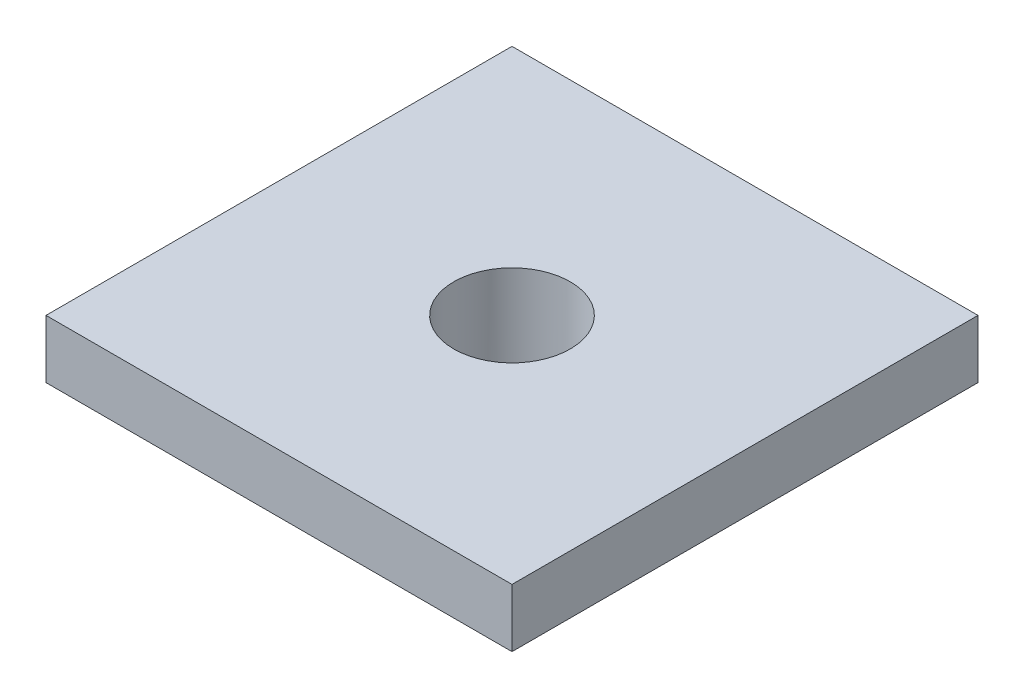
from build123d import *

# Parameters (mm, degrees)
SK1_W       = 80
SK1_H       = 80
BOSS1_DEPTH = 10
SK2_W       = 50
SK2_H       = 50
BOSS2_DEPTH = 15
SK3_R       = 10
CUT3_DEPTH  = 25


with BuildPart() as part:
    # Sk1 → Boss1 (new body)
    with BuildSketch(Plane(origin=(0, 0, 0), x_dir=(1, 0, 0), z_dir=(0, 1, 0))):
        with Locations((40, 40)):
            Rectangle(SK1_W, SK1_H)
    extrude(amount=-BOSS1_DEPTH)

    # Sk2 → Boss2 (add)
    with BuildSketch(Plane(origin=(0, 0, 0), x_dir=(1, 0, 0), z_dir=(0, 1, 0))):
        with Locations((40, 40)):
            Rectangle(SK2_W, SK2_H)
    extrude(amount=-BOSS2_DEPTH)

    # Sk3 → Cut3 (cut)
    with BuildSketch(Plane(origin=(0, 0, 0), x_dir=(1, 0, 0), z_dir=(0, 1, 0))):
        with Locations(Location((40, 40, 0), (0, 0, 270))):
            Circle(SK3_R)
    extrude(amount=-CUT3_DEPTH, mode=Mode.SUBTRACT)


solid = part.part
